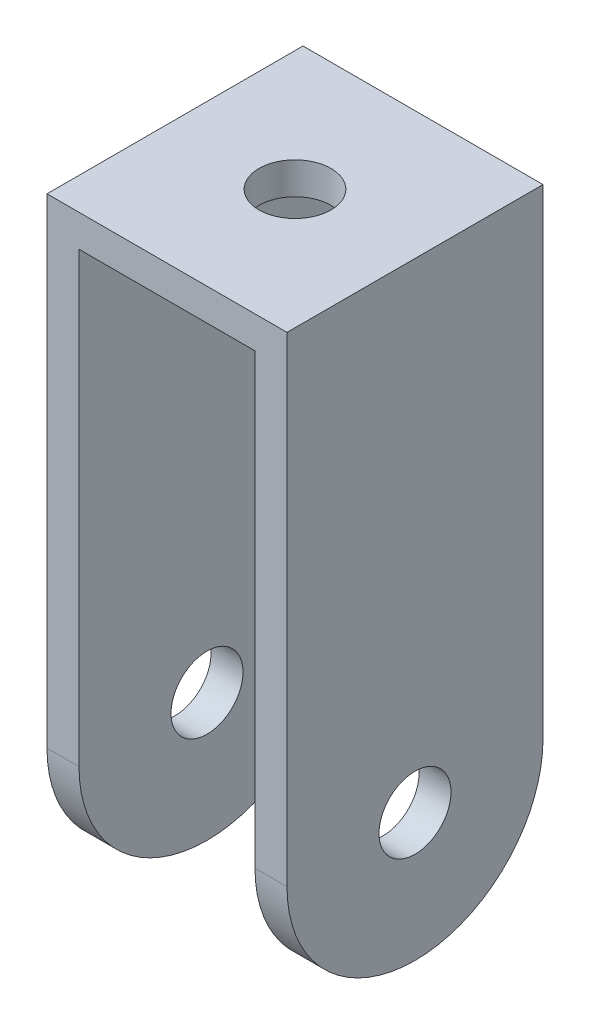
ISO-10303-21;
HEADER;
FILE_DESCRIPTION(('STEP AP214'),'2;1');
FILE_NAME('part.step','',(''),(''),'','','');
FILE_SCHEMA(('AUTOMOTIVE_DESIGN { 1 0 10303 214 1 1 1 1 }'));
ENDSEC;
DATA;
#1=APPLICATION_CONTEXT('core data for automotive mechanical design processes');
#2=APPLICATION_PROTOCOL_DEFINITION('international standard','automotive_design',2000,#1);
#3=PRODUCT_CONTEXT('',#1,'mechanical');
#4=PRODUCT('Part','Part','',(#3));
#5=PRODUCT_RELATED_PRODUCT_CATEGORY('part','',(#4));
#6=PRODUCT_DEFINITION_FORMATION('','',#4);
#7=PRODUCT_DEFINITION_CONTEXT('part definition',#1,'design');
#8=PRODUCT_DEFINITION('design','',#6,#7);
#9=PRODUCT_DEFINITION_SHAPE('','',#8);
#10=(LENGTH_UNIT() NAMED_UNIT(*) SI_UNIT(.MILLI.,.METRE.));
#11=(NAMED_UNIT(*) PLANE_ANGLE_UNIT() SI_UNIT($,.RADIAN.));
#12=(NAMED_UNIT(*) SI_UNIT($,.STERADIAN.) SOLID_ANGLE_UNIT());
#13=UNCERTAINTY_MEASURE_WITH_UNIT(LENGTH_MEASURE(1.E-05),#10,'distance_accuracy_value','');
#14=(GEOMETRIC_REPRESENTATION_CONTEXT(3) GLOBAL_UNCERTAINTY_ASSIGNED_CONTEXT((#13)) GLOBAL_UNIT_ASSIGNED_CONTEXT((#10,
#11,#12)) REPRESENTATION_CONTEXT('',''));
#15=CARTESIAN_POINT('',(0.,0.,0.));
#16=DIRECTION('',(0.,0.,1.));
#17=DIRECTION('',(1.,0.,0.));
#18=AXIS2_PLACEMENT_3D('',#15,#16,#17);
#19=CARTESIAN_POINT('',(0.,0.,16.));
#20=DIRECTION('',(0.,0.,-1.));
#21=DIRECTION('',(-1.,0.,0.));
#22=AXIS2_PLACEMENT_3D('',#19,#20,#21);
#23=PLANE('',#22);
#24=DIRECTION('',(1.,0.,0.));
#25=VECTOR('',#24,1.);
#26=CARTESIAN_POINT('',(-1.,15.2300650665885,16.));
#27=LINE('',#26,#25);
#28=CARTESIAN_POINT('',(13.,15.2300650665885,16.));
#29=VERTEX_POINT('',#28);
#30=CARTESIAN_POINT('',(15.,15.2300650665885,16.));
#31=VERTEX_POINT('',#30);
#32=EDGE_CURVE('E96',#29,#31,#27,.T.);
#33=ORIENTED_EDGE('',*,*,#32,.T.);
#34=DIRECTION('',(0.,1.,0.));
#35=VECTOR('',#34,1.);
#36=CARTESIAN_POINT('',(15.,45.2300650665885,16.));
#37=LINE('',#36,#35);
#38=CARTESIAN_POINT('',(15.,45.2300650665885,16.));
#39=VERTEX_POINT('',#38);
#40=EDGE_CURVE('E103',#31,#39,#37,.T.);
#41=ORIENTED_EDGE('',*,*,#40,.T.);
#42=DIRECTION('',(-1.,0.,0.));
#43=VECTOR('',#42,1.);
#44=CARTESIAN_POINT('',(0.,45.2300650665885,16.));
#45=LINE('',#44,#43);
#46=CARTESIAN_POINT('',(0.,45.2300650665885,16.));
#47=VERTEX_POINT('',#46);
#48=EDGE_CURVE('E113',#39,#47,#45,.T.);
#49=ORIENTED_EDGE('',*,*,#48,.T.);
#50=DIRECTION('',(0.,-1.,0.));
#51=VECTOR('',#50,1.);
#52=CARTESIAN_POINT('',(0.,0.,16.));
#53=LINE('',#52,#51);
#54=CARTESIAN_POINT('',(0.,15.2300650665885,16.));
#55=VERTEX_POINT('',#54);
#56=EDGE_CURVE('E115',#47,#55,#53,.T.);
#57=ORIENTED_EDGE('',*,*,#56,.T.);
#58=CARTESIAN_POINT('',(2.,15.2300650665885,16.));
#59=VERTEX_POINT('',#58);
#60=EDGE_CURVE('E107',#55,#59,#27,.T.);
#61=ORIENTED_EDGE('',*,*,#60,.T.);
#62=DIRECTION('',(0.,1.,0.));
#63=VECTOR('',#62,1.);
#64=CARTESIAN_POINT('',(2.,43.2300650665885,16.));
#65=LINE('',#64,#63);
#66=CARTESIAN_POINT('',(2.,43.2300650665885,16.));
#67=VERTEX_POINT('',#66);
#68=EDGE_CURVE('E139',#59,#67,#65,.T.);
#69=ORIENTED_EDGE('',*,*,#68,.T.);
#70=DIRECTION('',(1.,0.,0.));
#71=VECTOR('',#70,1.);
#72=CARTESIAN_POINT('',(13.,43.2300650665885,16.));
#73=LINE('',#72,#71);
#74=CARTESIAN_POINT('',(13.,43.2300650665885,16.));
#75=VERTEX_POINT('',#74);
#76=EDGE_CURVE('E117',#67,#75,#73,.T.);
#77=ORIENTED_EDGE('',*,*,#76,.T.);
#78=DIRECTION('',(0.,-1.,0.));
#79=VECTOR('',#78,1.);
#80=CARTESIAN_POINT('',(13.,0.,16.));
#81=LINE('',#80,#79);
#82=EDGE_CURVE('E106',#75,#29,#81,.T.);
#83=ORIENTED_EDGE('',*,*,#82,.T.);
#84=EDGE_LOOP('',(#33,#41,#49,#57,#61,#69,#77,#83));
#85=FACE_BOUND('',#84,.T.);
#86=ADVANCED_FACE('F31',(#85),#23,.F.);
#87=CARTESIAN_POINT('',(0.,0.,0.));
#88=DIRECTION('',(0.,0.,-1.));
#89=DIRECTION('',(-1.,0.,0.));
#90=AXIS2_PLACEMENT_3D('',#87,#88,#89);
#91=PLANE('',#90);
#92=DIRECTION('',(0.,1.,0.));
#93=VECTOR('',#92,1.);
#94=CARTESIAN_POINT('',(15.,45.2300650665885,0.));
#95=LINE('',#94,#93);
#96=CARTESIAN_POINT('',(15.,15.2300650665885,0.));
#97=VERTEX_POINT('',#96);
#98=CARTESIAN_POINT('',(15.,45.2300650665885,0.));
#99=VERTEX_POINT('',#98);
#100=EDGE_CURVE('E132',#97,#99,#95,.T.);
#101=ORIENTED_EDGE('',*,*,#100,.F.);
#102=DIRECTION('',(1.,0.,0.));
#103=VECTOR('',#102,1.);
#104=CARTESIAN_POINT('',(-1.,15.2300650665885,0.));
#105=LINE('',#104,#103);
#106=CARTESIAN_POINT('',(13.,15.2300650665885,0.));
#107=VERTEX_POINT('',#106);
#108=EDGE_CURVE('E11',#97,#107,#105,.F.);
#109=ORIENTED_EDGE('',*,*,#108,.T.);
#110=DIRECTION('',(0.,-1.,0.));
#111=VECTOR('',#110,1.);
#112=CARTESIAN_POINT('',(13.,0.,0.));
#113=LINE('',#112,#111);
#114=CARTESIAN_POINT('',(13.,43.2300650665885,0.));
#115=VERTEX_POINT('',#114);
#116=EDGE_CURVE('E129',#115,#107,#113,.T.);
#117=ORIENTED_EDGE('',*,*,#116,.F.);
#118=DIRECTION('',(1.,0.,0.));
#119=VECTOR('',#118,1.);
#120=CARTESIAN_POINT('',(13.,43.2300650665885,0.));
#121=LINE('',#120,#119);
#122=CARTESIAN_POINT('',(2.,43.2300650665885,0.));
#123=VERTEX_POINT('',#122);
#124=EDGE_CURVE('E126',#123,#115,#121,.T.);
#125=ORIENTED_EDGE('',*,*,#124,.F.);
#126=DIRECTION('',(0.,1.,0.));
#127=VECTOR('',#126,1.);
#128=CARTESIAN_POINT('',(2.,43.2300650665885,0.));
#129=LINE('',#128,#127);
#130=CARTESIAN_POINT('',(2.,15.2300650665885,0.));
#131=VERTEX_POINT('',#130);
#132=EDGE_CURVE('E124',#131,#123,#129,.T.);
#133=ORIENTED_EDGE('',*,*,#132,.F.);
#134=CARTESIAN_POINT('',(0.,15.2300650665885,0.));
#135=VERTEX_POINT('',#134);
#136=EDGE_CURVE('E35',#131,#135,#105,.F.);
#137=ORIENTED_EDGE('',*,*,#136,.T.);
#138=DIRECTION('',(0.,-1.,0.));
#139=VECTOR('',#138,1.);
#140=CARTESIAN_POINT('',(0.,0.,0.));
#141=LINE('',#140,#139);
#142=CARTESIAN_POINT('',(0.,45.2300650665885,0.));
#143=VERTEX_POINT('',#142);
#144=EDGE_CURVE('E136',#143,#135,#141,.T.);
#145=ORIENTED_EDGE('',*,*,#144,.F.);
#146=DIRECTION('',(-1.,0.,0.));
#147=VECTOR('',#146,1.);
#148=CARTESIAN_POINT('',(0.,45.2300650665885,0.));
#149=LINE('',#148,#147);
#150=EDGE_CURVE('E134',#99,#143,#149,.T.);
#151=ORIENTED_EDGE('',*,*,#150,.F.);
#152=EDGE_LOOP('',(#101,#109,#117,#125,#133,#137,#145,#151));
#153=FACE_BOUND('',#152,.T.);
#154=ADVANCED_FACE('F190',(#153),#91,.T.);
#155=CARTESIAN_POINT('',(2.,43.2300650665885,16.));
#156=DIRECTION('',(-1.,0.,0.));
#157=DIRECTION('',(0.,-1.,0.));
#158=AXIS2_PLACEMENT_3D('',#155,#156,#157);
#159=PLANE('',#158);
#160=CARTESIAN_POINT('',(2.,15.2300650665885,8.));
#161=DIRECTION('',(-1.,0.,0.));
#162=DIRECTION('',(0.,-1.,0.));
#163=AXIS2_PLACEMENT_3D('',#160,#161,#162);
#164=CIRCLE('',#163,2.25);
#165=CARTESIAN_POINT('',(2.,12.9800650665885,8.));
#166=VERTEX_POINT('',#165);
#167=EDGE_CURVE('E155',#166,#166,#164,.T.);
#168=ORIENTED_EDGE('',*,*,#167,.T.);
#169=EDGE_LOOP('',(#168));
#170=FACE_BOUND('',#169,.T.);
#171=ORIENTED_EDGE('',*,*,#68,.F.);
#172=CARTESIAN_POINT('',(2.,15.2300650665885,8.));
#173=DIRECTION('',(-1.,0.,0.));
#174=DIRECTION('',(0.,-1.,0.));
#175=AXIS2_PLACEMENT_3D('',#172,#173,#174);
#176=CIRCLE('',#175,8.);
#177=EDGE_CURVE('E158',#59,#131,#176,.F.);
#178=ORIENTED_EDGE('',*,*,#177,.T.);
#179=ORIENTED_EDGE('',*,*,#132,.T.);
#180=DIRECTION('',(0.,0.,-1.));
#181=VECTOR('',#180,1.);
#182=CARTESIAN_POINT('',(2.,43.2300650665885,16.));
#183=LINE('',#182,#181);
#184=EDGE_CURVE('E146',#67,#123,#183,.T.);
#185=ORIENTED_EDGE('',*,*,#184,.F.);
#186=EDGE_LOOP('',(#171,#178,#179,#185));
#187=FACE_BOUND('',#186,.T.);
#188=ADVANCED_FACE('F33',(#170,#187),#159,.F.);
#189=CARTESIAN_POINT('',(13.,43.2300650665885,16.));
#190=DIRECTION('',(0.,1.,0.));
#191=DIRECTION('',(0.,0.,1.));
#192=AXIS2_PLACEMENT_3D('',#189,#190,#191);
#193=PLANE('',#192);
#194=CARTESIAN_POINT('',(7.5,43.2300650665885,8.));
#195=DIRECTION('',(0.,1.,0.));
#196=DIRECTION('',(0.,0.,1.));
#197=AXIS2_PLACEMENT_3D('',#194,#195,#196);
#198=CIRCLE('',#197,2.25);
#199=CARTESIAN_POINT('',(7.5,43.2300650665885,10.25));
#200=VERTEX_POINT('',#199);
#201=EDGE_CURVE('E127',#200,#200,#198,.T.);
#202=ORIENTED_EDGE('',*,*,#201,.T.);
#203=EDGE_LOOP('',(#202));
#204=FACE_BOUND('',#203,.T.);
#205=ORIENTED_EDGE('',*,*,#124,.T.);
#206=DIRECTION('',(0.,0.,-1.));
#207=VECTOR('',#206,1.);
#208=CARTESIAN_POINT('',(13.,43.2300650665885,16.));
#209=LINE('',#208,#207);
#210=EDGE_CURVE('E143',#75,#115,#209,.T.);
#211=ORIENTED_EDGE('',*,*,#210,.F.);
#212=ORIENTED_EDGE('',*,*,#76,.F.);
#213=ORIENTED_EDGE('',*,*,#184,.T.);
#214=EDGE_LOOP('',(#205,#211,#212,#213));
#215=FACE_BOUND('',#214,.T.);
#216=ADVANCED_FACE('F179',(#204,#215),#193,.F.);
#217=CARTESIAN_POINT('',(13.,0.,16.));
#218=DIRECTION('',(1.,0.,0.));
#219=DIRECTION('',(0.,0.,-1.));
#220=AXIS2_PLACEMENT_3D('',#217,#218,#219);
#221=PLANE('',#220);
#222=CARTESIAN_POINT('',(13.,15.2300650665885,8.));
#223=DIRECTION('',(1.,0.,0.));
#224=DIRECTION('',(0.,0.,-1.));
#225=AXIS2_PLACEMENT_3D('',#222,#223,#224);
#226=CIRCLE('',#225,2.25);
#227=CARTESIAN_POINT('',(13.,15.2300650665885,5.74999999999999));
#228=VERTEX_POINT('',#227);
#229=EDGE_CURVE('E150',#228,#228,#226,.T.);
#230=ORIENTED_EDGE('',*,*,#229,.T.);
#231=EDGE_LOOP('',(#230));
#232=FACE_BOUND('',#231,.T.);
#233=ORIENTED_EDGE('',*,*,#116,.T.);
#234=CARTESIAN_POINT('',(13.,15.2300650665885,8.));
#235=DIRECTION('',(1.,0.,0.));
#236=DIRECTION('',(0.,0.,-1.));
#237=AXIS2_PLACEMENT_3D('',#234,#235,#236);
#238=CIRCLE('',#237,8.);
#239=EDGE_CURVE('E46',#107,#29,#238,.F.);
#240=ORIENTED_EDGE('',*,*,#239,.T.);
#241=ORIENTED_EDGE('',*,*,#82,.F.);
#242=ORIENTED_EDGE('',*,*,#210,.T.);
#243=EDGE_LOOP('',(#233,#240,#241,#242));
#244=FACE_BOUND('',#243,.T.);
#245=ADVANCED_FACE('F183',(#232,#244),#221,.F.);
#246=CARTESIAN_POINT('',(15.,45.2300650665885,16.));
#247=DIRECTION('',(-1.,0.,0.));
#248=DIRECTION('',(0.,0.,1.));
#249=AXIS2_PLACEMENT_3D('',#246,#247,#248);
#250=PLANE('',#249);
#251=CARTESIAN_POINT('',(15.,15.2300650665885,8.));
#252=DIRECTION('',(1.,0.,0.));
#253=DIRECTION('',(0.,0.,-1.));
#254=AXIS2_PLACEMENT_3D('',#251,#252,#253);
#255=CIRCLE('',#254,2.25);
#256=CARTESIAN_POINT('',(15.,15.2300650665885,5.74999999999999));
#257=VERTEX_POINT('',#256);
#258=EDGE_CURVE('E151',#257,#257,#255,.T.);
#259=ORIENTED_EDGE('',*,*,#258,.F.);
#260=EDGE_LOOP('',(#259));
#261=FACE_BOUND('',#260,.T.);
#262=ORIENTED_EDGE('',*,*,#40,.F.);
#263=CARTESIAN_POINT('',(15.,15.2300650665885,8.));
#264=DIRECTION('',(-1.,0.,0.));
#265=DIRECTION('',(0.,0.,-1.));
#266=AXIS2_PLACEMENT_3D('',#263,#264,#265);
#267=CIRCLE('',#266,8.);
#268=EDGE_CURVE('E93',#97,#31,#267,.T.);
#269=ORIENTED_EDGE('',*,*,#268,.F.);
#270=ORIENTED_EDGE('',*,*,#100,.T.);
#271=DIRECTION('',(0.,0.,-1.));
#272=VECTOR('',#271,1.);
#273=CARTESIAN_POINT('',(15.,45.2300650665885,16.));
#274=LINE('',#273,#272);
#275=EDGE_CURVE('E111',#39,#99,#274,.T.);
#276=ORIENTED_EDGE('',*,*,#275,.F.);
#277=EDGE_LOOP('',(#262,#269,#270,#276));
#278=FACE_BOUND('',#277,.T.);
#279=ADVANCED_FACE('F109',(#261,#278),#250,.F.);
#280=CARTESIAN_POINT('',(0.,45.2300650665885,16.));
#281=DIRECTION('',(0.,-1.,0.));
#282=DIRECTION('',(0.,0.,-1.));
#283=AXIS2_PLACEMENT_3D('',#280,#281,#282);
#284=PLANE('',#283);
#285=CARTESIAN_POINT('',(7.5,45.2300650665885,8.));
#286=DIRECTION('',(0.,1.,0.));
#287=DIRECTION('',(0.,0.,1.));
#288=AXIS2_PLACEMENT_3D('',#285,#286,#287);
#289=CIRCLE('',#288,2.25);
#290=CARTESIAN_POINT('',(7.5,45.2300650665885,10.25));
#291=VERTEX_POINT('',#290);
#292=EDGE_CURVE('E168',#291,#291,#289,.T.);
#293=ORIENTED_EDGE('',*,*,#292,.F.);
#294=EDGE_LOOP('',(#293));
#295=FACE_BOUND('',#294,.T.);
#296=ORIENTED_EDGE('',*,*,#150,.T.);
#297=DIRECTION('',(0.,0.,-1.));
#298=VECTOR('',#297,1.);
#299=CARTESIAN_POINT('',(0.,45.2300650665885,16.));
#300=LINE('',#299,#298);
#301=EDGE_CURVE('E123',#47,#143,#300,.T.);
#302=ORIENTED_EDGE('',*,*,#301,.F.);
#303=ORIENTED_EDGE('',*,*,#48,.F.);
#304=ORIENTED_EDGE('',*,*,#275,.T.);
#305=EDGE_LOOP('',(#296,#302,#303,#304));
#306=FACE_BOUND('',#305,.T.);
#307=ADVANCED_FACE('F194',(#295,#306),#284,.F.);
#308=CARTESIAN_POINT('',(0.,0.,16.));
#309=DIRECTION('',(1.,0.,0.));
#310=DIRECTION('',(0.,0.,-1.));
#311=AXIS2_PLACEMENT_3D('',#308,#309,#310);
#312=PLANE('',#311);
#313=CARTESIAN_POINT('',(0.,15.2300650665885,8.));
#314=DIRECTION('',(1.,0.,0.));
#315=DIRECTION('',(0.,0.,-1.));
#316=AXIS2_PLACEMENT_3D('',#313,#314,#315);
#317=CIRCLE('',#316,2.25);
#318=CARTESIAN_POINT('',(0.,15.2300650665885,5.74999999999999));
#319=VERTEX_POINT('',#318);
#320=EDGE_CURVE('E148',#319,#319,#317,.T.);
#321=ORIENTED_EDGE('',*,*,#320,.T.);
#322=EDGE_LOOP('',(#321));
#323=FACE_BOUND('',#322,.T.);
#324=ORIENTED_EDGE('',*,*,#144,.T.);
#325=CARTESIAN_POINT('',(0.,15.2300650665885,8.));
#326=DIRECTION('',(1.,0.,0.));
#327=DIRECTION('',(0.,0.,-1.));
#328=AXIS2_PLACEMENT_3D('',#325,#326,#327);
#329=CIRCLE('',#328,8.);
#330=EDGE_CURVE('E53',#135,#55,#329,.F.);
#331=ORIENTED_EDGE('',*,*,#330,.T.);
#332=ORIENTED_EDGE('',*,*,#56,.F.);
#333=ORIENTED_EDGE('',*,*,#301,.T.);
#334=EDGE_LOOP('',(#324,#331,#332,#333));
#335=FACE_BOUND('',#334,.T.);
#336=ADVANCED_FACE('F196',(#323,#335),#312,.F.);
#337=CARTESIAN_POINT('',(7.5,0.,8.));
#338=DIRECTION('',(0.,1.,0.));
#339=DIRECTION('',(0.,0.,1.));
#340=AXIS2_PLACEMENT_3D('',#337,#338,#339);
#341=CYLINDRICAL_SURFACE('',#340,2.25);
#342=CARTESIAN_POINT('',(7.5,45.2300650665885,10.25));
#343=CARTESIAN_POINT('',(7.5,45.2092317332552,10.25));
#344=CARTESIAN_POINT('',(7.5,45.1883983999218,10.25));
#345=CARTESIAN_POINT('',(7.5,45.1467317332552,10.25));
#346=CARTESIAN_POINT('',(7.5,45.1258983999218,10.25));
#347=CARTESIAN_POINT('',(7.5,45.0842317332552,10.25));
#348=CARTESIAN_POINT('',(7.5,45.0633983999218,10.25));
#349=CARTESIAN_POINT('',(7.5,45.0217317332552,10.25));
#350=CARTESIAN_POINT('',(7.5,45.0008983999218,10.25));
#351=CARTESIAN_POINT('',(7.5,44.9592317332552,10.25));
#352=CARTESIAN_POINT('',(7.5,44.9383983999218,10.25));
#353=CARTESIAN_POINT('',(7.5,44.8967317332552,10.25));
#354=CARTESIAN_POINT('',(7.5,44.8758983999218,10.25));
#355=CARTESIAN_POINT('',(7.5,44.8342317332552,10.25));
#356=CARTESIAN_POINT('',(7.5,44.8133983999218,10.25));
#357=CARTESIAN_POINT('',(7.5,44.7717317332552,10.25));
#358=CARTESIAN_POINT('',(7.5,44.7508983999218,10.25));
#359=CARTESIAN_POINT('',(7.5,44.7092317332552,10.25));
#360=CARTESIAN_POINT('',(7.5,44.6883983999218,10.25));
#361=CARTESIAN_POINT('',(7.5,44.6467317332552,10.25));
#362=CARTESIAN_POINT('',(7.5,44.6258983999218,10.25));
#363=CARTESIAN_POINT('',(7.5,44.5842317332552,10.25));
#364=CARTESIAN_POINT('',(7.5,44.5633983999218,10.25));
#365=CARTESIAN_POINT('',(7.5,44.5217317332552,10.25));
#366=CARTESIAN_POINT('',(7.5,44.5008983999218,10.25));
#367=CARTESIAN_POINT('',(7.5,44.4592317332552,10.25));
#368=CARTESIAN_POINT('',(7.5,44.4383983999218,10.25));
#369=CARTESIAN_POINT('',(7.5,44.3967317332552,10.25));
#370=CARTESIAN_POINT('',(7.5,44.3758983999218,10.25));
#371=CARTESIAN_POINT('',(7.5,44.3342317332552,10.25));
#372=CARTESIAN_POINT('',(7.5,44.3133983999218,10.25));
#373=CARTESIAN_POINT('',(7.5,44.2717317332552,10.25));
#374=CARTESIAN_POINT('',(7.5,44.2508983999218,10.25));
#375=CARTESIAN_POINT('',(7.5,44.2092317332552,10.25));
#376=CARTESIAN_POINT('',(7.5,44.1883983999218,10.25));
#377=CARTESIAN_POINT('',(7.5,44.1467317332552,10.25));
#378=CARTESIAN_POINT('',(7.5,44.1258983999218,10.25));
#379=CARTESIAN_POINT('',(7.5,44.0842317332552,10.25));
#380=CARTESIAN_POINT('',(7.5,44.0633983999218,10.25));
#381=CARTESIAN_POINT('',(7.5,44.0217317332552,10.25));
#382=CARTESIAN_POINT('',(7.5,44.0008983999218,10.25));
#383=CARTESIAN_POINT('',(7.5,43.9592317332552,10.25));
#384=CARTESIAN_POINT('',(7.5,43.9383983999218,10.25));
#385=CARTESIAN_POINT('',(7.5,43.8967317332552,10.25));
#386=CARTESIAN_POINT('',(7.5,43.8758983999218,10.25));
#387=CARTESIAN_POINT('',(7.5,43.8342317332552,10.25));
#388=CARTESIAN_POINT('',(7.5,43.8133983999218,10.25));
#389=CARTESIAN_POINT('',(7.5,43.7717317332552,10.25));
#390=CARTESIAN_POINT('',(7.5,43.7508983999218,10.25));
#391=CARTESIAN_POINT('',(7.5,43.7092317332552,10.25));
#392=CARTESIAN_POINT('',(7.5,43.6883983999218,10.25));
#393=CARTESIAN_POINT('',(7.5,43.6467317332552,10.25));
#394=CARTESIAN_POINT('',(7.5,43.6258983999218,10.25));
#395=CARTESIAN_POINT('',(7.5,43.5842317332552,10.25));
#396=CARTESIAN_POINT('',(7.5,43.5633983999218,10.25));
#397=CARTESIAN_POINT('',(7.5,43.5217317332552,10.25));
#398=CARTESIAN_POINT('',(7.5,43.5008983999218,10.25));
#399=CARTESIAN_POINT('',(7.5,43.4592317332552,10.25));
#400=CARTESIAN_POINT('',(7.5,43.4383983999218,10.25));
#401=CARTESIAN_POINT('',(7.5,43.3967317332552,10.25));
#402=CARTESIAN_POINT('',(7.5,43.3758983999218,10.25));
#403=CARTESIAN_POINT('',(7.5,43.3342317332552,10.25));
#404=CARTESIAN_POINT('',(7.5,43.3133983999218,10.25));
#405=CARTESIAN_POINT('',(7.5,43.2717317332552,10.25));
#406=CARTESIAN_POINT('',(7.5,43.2508983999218,10.25));
#407=CARTESIAN_POINT('',(7.5,43.2300650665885,10.25));
#408=B_SPLINE_CURVE_WITH_KNOTS('',3,(#342,#343,#344,#345,#346,#347,#348,#349,#350,#351,#352,
#353,#354,#355,#356,#357,#358,#359,#360,#361,#362,#363,#364,#365,#366,#367,#368,#369,#370,#371,
#372,#373,#374,#375,#376,#377,#378,#379,#380,#381,#382,#383,#384,#385,#386,#387,#388,#389,#390,
#391,#392,#393,#394,#395,#396,#397,#398,#399,#400,#401,#402,#403,#404,#405,#406,#407),
.UNSPECIFIED.,.F.,.F.,(4,2,2,2,2,2,2,2,2,2,2,2,2,2,2,2,2,2,2,2,2,2,2,2,2,2,2,2,2,2,2,2,4),(0.,
0.0625000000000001,0.125,0.1875,0.25,0.3125,0.375,0.4375,0.5,0.5625,0.625000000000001,
0.687500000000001,0.750000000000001,0.812500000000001,0.875000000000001,0.937500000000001,1.,
1.0625,1.125,1.1875,1.25,1.3125,1.375,1.4375,1.5,1.5625,1.625,1.6875,1.75,1.8125,1.875,1.9375,
2.),.UNSPECIFIED.);
#409=EDGE_CURVE('BSEAM198',#291,#200,#408,.T.);
#410=ORIENTED_EDGE('',*,*,#292,.T.);
#411=ORIENTED_EDGE('',*,*,#201,.F.);
#412=ORIENTED_EDGE('',*,*,#409,.T.);
#413=ORIENTED_EDGE('',*,*,#409,.F.);
#414=EDGE_LOOP('',(#410,#412,#411,#413));
#415=FACE_BOUND('',#414,.T.);
#416=ADVANCED_FACE('F198',(#415),#341,.F.);
#417=CARTESIAN_POINT('',(-1.,15.2300650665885,8.));
#418=DIRECTION('',(1.,0.,0.));
#419=DIRECTION('',(0.,0.,-1.));
#420=AXIS2_PLACEMENT_3D('',#417,#418,#419);
#421=CYLINDRICAL_SURFACE('',#420,2.25);
#422=ORIENTED_EDGE('',*,*,#320,.F.);
#423=EDGE_LOOP('',(#422));
#424=FACE_BOUND('',#423,.T.);
#425=ORIENTED_EDGE('',*,*,#167,.F.);
#426=EDGE_LOOP('',(#425));
#427=FACE_BOUND('',#426,.T.);
#428=ADVANCED_FACE('F204',(#424,#427),#421,.F.);
#429=ORIENTED_EDGE('',*,*,#258,.T.);
#430=EDGE_LOOP('',(#429));
#431=FACE_BOUND('',#430,.T.);
#432=ORIENTED_EDGE('',*,*,#229,.F.);
#433=EDGE_LOOP('',(#432));
#434=FACE_BOUND('',#433,.T.);
#435=ADVANCED_FACE('F218',(#431,#434),#421,.F.);
#436=CARTESIAN_POINT('',(-1.,15.2300650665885,8.));
#437=DIRECTION('',(1.,0.,0.));
#438=DIRECTION('',(0.,0.,-1.));
#439=AXIS2_PLACEMENT_3D('',#436,#437,#438);
#440=CYLINDRICAL_SURFACE('',#439,8.);
#441=ORIENTED_EDGE('',*,*,#60,.F.);
#442=ORIENTED_EDGE('',*,*,#330,.F.);
#443=ORIENTED_EDGE('',*,*,#136,.F.);
#444=ORIENTED_EDGE('',*,*,#177,.F.);
#445=EDGE_LOOP('',(#441,#442,#443,#444));
#446=FACE_BOUND('',#445,.T.);
#447=ADVANCED_FACE('F220',(#446),#440,.T.);
#448=ORIENTED_EDGE('',*,*,#108,.F.);
#449=ORIENTED_EDGE('',*,*,#268,.T.);
#450=ORIENTED_EDGE('',*,*,#32,.F.);
#451=ORIENTED_EDGE('',*,*,#239,.F.);
#452=EDGE_LOOP('',(#448,#449,#450,#451));
#453=FACE_BOUND('',#452,.T.);
#454=ADVANCED_FACE('F95',(#453),#440,.T.);
#455=CLOSED_SHELL('',(#86,#154,#188,#216,#245,#279,#307,#336,#416,#428,#435,#447,#454));
#456=MANIFOLD_SOLID_BREP('B2',#455);
#457=ADVANCED_BREP_SHAPE_REPRESENTATION('',(#18,#456),#14);
#458=SHAPE_DEFINITION_REPRESENTATION(#9,#457);
ENDSEC;
END-ISO-10303-21;
